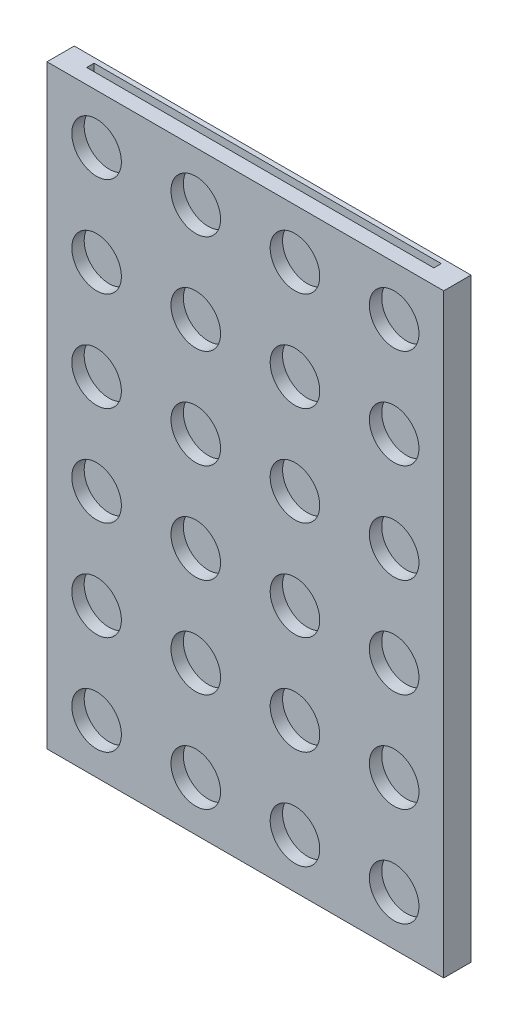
ISO-10303-21;
HEADER;
FILE_DESCRIPTION(('STEP AP214'),'2;1');
FILE_NAME('part.step','',(''),(''),'','','');
FILE_SCHEMA(('AUTOMOTIVE_DESIGN { 1 0 10303 214 1 1 1 1 }'));
ENDSEC;
DATA;
#1=APPLICATION_CONTEXT('core data for automotive mechanical design processes');
#2=APPLICATION_PROTOCOL_DEFINITION('international standard','automotive_design',2000,#1);
#3=PRODUCT_CONTEXT('',#1,'mechanical');
#4=PRODUCT('Part','Part','',(#3));
#5=PRODUCT_RELATED_PRODUCT_CATEGORY('part','',(#4));
#6=PRODUCT_DEFINITION_FORMATION('','',#4);
#7=PRODUCT_DEFINITION_CONTEXT('part definition',#1,'design');
#8=PRODUCT_DEFINITION('design','',#6,#7);
#9=PRODUCT_DEFINITION_SHAPE('','',#8);
#10=(LENGTH_UNIT() NAMED_UNIT(*) SI_UNIT(.MILLI.,.METRE.));
#11=(NAMED_UNIT(*) PLANE_ANGLE_UNIT() SI_UNIT($,.RADIAN.));
#12=(NAMED_UNIT(*) SI_UNIT($,.STERADIAN.) SOLID_ANGLE_UNIT());
#13=UNCERTAINTY_MEASURE_WITH_UNIT(LENGTH_MEASURE(1.E-05),#10,'distance_accuracy_value','');
#14=(GEOMETRIC_REPRESENTATION_CONTEXT(3) GLOBAL_UNCERTAINTY_ASSIGNED_CONTEXT((#13)) GLOBAL_UNIT_ASSIGNED_CONTEXT((#10,
#11,#12)) REPRESENTATION_CONTEXT('',''));
#15=CARTESIAN_POINT('',(0.,0.,0.));
#16=DIRECTION('',(0.,0.,1.));
#17=DIRECTION('',(1.,0.,0.));
#18=AXIS2_PLACEMENT_3D('',#15,#16,#17);
#19=CARTESIAN_POINT('',(0.,0.,6.985));
#20=DIRECTION('',(0.,0.,-1.));
#21=DIRECTION('',(-1.,0.,0.));
#22=AXIS2_PLACEMENT_3D('',#19,#20,#21);
#23=PLANE('',#22);
#24=CARTESIAN_POINT('',(88.9,88.9,6.985));
#25=DIRECTION('',(0.,0.,1.));
#26=DIRECTION('',(1.,0.,0.));
#27=AXIS2_PLACEMENT_3D('',#24,#25,#26);
#28=CIRCLE('',#27,6.34999999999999);
#29=CARTESIAN_POINT('',(95.25,88.9,6.985));
#30=VERTEX_POINT('',#29);
#31=EDGE_CURVE('E303',#30,#30,#28,.T.);
#32=ORIENTED_EDGE('',*,*,#31,.F.);
#33=EDGE_LOOP('',(#32));
#34=FACE_BOUND('',#33,.T.);
#35=CARTESIAN_POINT('',(63.5,88.9,6.985));
#36=DIRECTION('',(0.,0.,1.));
#37=DIRECTION('',(1.,0.,0.));
#38=AXIS2_PLACEMENT_3D('',#35,#36,#37);
#39=CIRCLE('',#38,6.34999999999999);
#40=CARTESIAN_POINT('',(69.85,88.9,6.985));
#41=VERTEX_POINT('',#40);
#42=EDGE_CURVE('E328',#41,#41,#39,.T.);
#43=ORIENTED_EDGE('',*,*,#42,.F.);
#44=EDGE_LOOP('',(#43));
#45=FACE_BOUND('',#44,.T.);
#46=CARTESIAN_POINT('',(38.1,88.9,6.985));
#47=DIRECTION('',(0.,0.,1.));
#48=DIRECTION('',(1.,0.,0.));
#49=AXIS2_PLACEMENT_3D('',#46,#47,#48);
#50=CIRCLE('',#49,6.35);
#51=CARTESIAN_POINT('',(44.45,88.9,6.985));
#52=VERTEX_POINT('',#51);
#53=EDGE_CURVE('E319',#52,#52,#50,.T.);
#54=ORIENTED_EDGE('',*,*,#53,.F.);
#55=EDGE_LOOP('',(#54));
#56=FACE_BOUND('',#55,.T.);
#57=CARTESIAN_POINT('',(12.7,38.1,6.985));
#58=DIRECTION('',(0.,0.,1.));
#59=DIRECTION('',(1.,0.,0.));
#60=AXIS2_PLACEMENT_3D('',#57,#58,#59);
#61=CIRCLE('',#60,6.35);
#62=CARTESIAN_POINT('',(19.05,38.1,6.985));
#63=VERTEX_POINT('',#62);
#64=EDGE_CURVE('E280',#63,#63,#61,.T.);
#65=ORIENTED_EDGE('',*,*,#64,.F.);
#66=EDGE_LOOP('',(#65));
#67=FACE_BOUND('',#66,.T.);
#68=CARTESIAN_POINT('',(38.1,139.7,6.985));
#69=DIRECTION('',(0.,0.,1.));
#70=DIRECTION('',(1.,0.,0.));
#71=AXIS2_PLACEMENT_3D('',#68,#69,#70);
#72=CIRCLE('',#71,6.35);
#73=CARTESIAN_POINT('',(44.45,139.7,6.985));
#74=VERTEX_POINT('',#73);
#75=EDGE_CURVE('E367',#74,#74,#72,.T.);
#76=ORIENTED_EDGE('',*,*,#75,.F.);
#77=EDGE_LOOP('',(#76));
#78=FACE_BOUND('',#77,.T.);
#79=CARTESIAN_POINT('',(63.5,139.7,6.985));
#80=DIRECTION('',(0.,0.,1.));
#81=DIRECTION('',(1.,0.,0.));
#82=AXIS2_PLACEMENT_3D('',#79,#80,#81);
#83=CIRCLE('',#82,6.34999999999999);
#84=CARTESIAN_POINT('',(69.85,139.7,6.985));
#85=VERTEX_POINT('',#84);
#86=EDGE_CURVE('E376',#85,#85,#83,.T.);
#87=ORIENTED_EDGE('',*,*,#86,.F.);
#88=EDGE_LOOP('',(#87));
#89=FACE_BOUND('',#88,.T.);
#90=CARTESIAN_POINT('',(88.9,139.7,6.985));
#91=DIRECTION('',(0.,0.,1.));
#92=DIRECTION('',(1.,0.,0.));
#93=AXIS2_PLACEMENT_3D('',#90,#91,#92);
#94=CIRCLE('',#93,6.34999999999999);
#95=CARTESIAN_POINT('',(95.25,139.7,6.985));
#96=VERTEX_POINT('',#95);
#97=EDGE_CURVE('E384',#96,#96,#94,.T.);
#98=ORIENTED_EDGE('',*,*,#97,.F.);
#99=EDGE_LOOP('',(#98));
#100=FACE_BOUND('',#99,.T.);
#101=CARTESIAN_POINT('',(12.7,88.9,6.985));
#102=DIRECTION('',(0.,0.,1.));
#103=DIRECTION('',(1.,0.,0.));
#104=AXIS2_PLACEMENT_3D('',#101,#102,#103);
#105=CIRCLE('',#104,6.35);
#106=CARTESIAN_POINT('',(19.05,88.9,6.985));
#107=VERTEX_POINT('',#106);
#108=EDGE_CURVE('E360',#107,#107,#105,.T.);
#109=ORIENTED_EDGE('',*,*,#108,.F.);
#110=EDGE_LOOP('',(#109));
#111=FACE_BOUND('',#110,.T.);
#112=CARTESIAN_POINT('',(38.1,38.1,6.985));
#113=DIRECTION('',(0.,0.,1.));
#114=DIRECTION('',(1.,0.,0.));
#115=AXIS2_PLACEMENT_3D('',#112,#113,#114);
#116=CIRCLE('',#115,6.35);
#117=CARTESIAN_POINT('',(44.45,38.1,6.985));
#118=VERTEX_POINT('',#117);
#119=EDGE_CURVE('E255',#118,#118,#116,.T.);
#120=ORIENTED_EDGE('',*,*,#119,.F.);
#121=EDGE_LOOP('',(#120));
#122=FACE_BOUND('',#121,.T.);
#123=CARTESIAN_POINT('',(63.5,38.1,6.985));
#124=DIRECTION('',(0.,0.,1.));
#125=DIRECTION('',(1.,0.,0.));
#126=AXIS2_PLACEMENT_3D('',#123,#124,#125);
#127=CIRCLE('',#126,6.35);
#128=CARTESIAN_POINT('',(69.85,38.1,6.985));
#129=VERTEX_POINT('',#128);
#130=EDGE_CURVE('E264',#129,#129,#127,.T.);
#131=ORIENTED_EDGE('',*,*,#130,.F.);
#132=EDGE_LOOP('',(#131));
#133=FACE_BOUND('',#132,.T.);
#134=CARTESIAN_POINT('',(88.9,38.1,6.985));
#135=DIRECTION('',(0.,0.,1.));
#136=DIRECTION('',(1.,0.,0.));
#137=AXIS2_PLACEMENT_3D('',#134,#135,#136);
#138=CIRCLE('',#137,6.35);
#139=CARTESIAN_POINT('',(95.25,38.1,6.985));
#140=VERTEX_POINT('',#139);
#141=EDGE_CURVE('E239',#140,#140,#138,.T.);
#142=ORIENTED_EDGE('',*,*,#141,.F.);
#143=EDGE_LOOP('',(#142));
#144=FACE_BOUND('',#143,.T.);
#145=CARTESIAN_POINT('',(12.7,139.7,6.985));
#146=DIRECTION('',(0.,0.,1.));
#147=DIRECTION('',(1.,0.,0.));
#148=AXIS2_PLACEMENT_3D('',#145,#146,#147);
#149=CIRCLE('',#148,6.35);
#150=CARTESIAN_POINT('',(19.05,139.7,6.985));
#151=VERTEX_POINT('',#150);
#152=EDGE_CURVE('E371',#151,#151,#149,.T.);
#153=ORIENTED_EDGE('',*,*,#152,.F.);
#154=EDGE_LOOP('',(#153));
#155=FACE_BOUND('',#154,.T.);
#156=DIRECTION('',(0.,-1.,0.));
#157=VECTOR('',#156,1.);
#158=CARTESIAN_POINT('',(0.,0.,6.985));
#159=LINE('',#158,#157);
#160=CARTESIAN_POINT('',(0.,152.4,6.985));
#161=VERTEX_POINT('',#160);
#162=CARTESIAN_POINT('',(0.,0.,6.985));
#163=VERTEX_POINT('',#162);
#164=EDGE_CURVE('E407',#161,#163,#159,.T.);
#165=ORIENTED_EDGE('',*,*,#164,.T.);
#166=DIRECTION('',(1.,0.,0.));
#167=VECTOR('',#166,1.);
#168=CARTESIAN_POINT('',(0.,0.,6.985));
#169=LINE('',#168,#167);
#170=CARTESIAN_POINT('',(101.6,0.,6.985));
#171=VERTEX_POINT('',#170);
#172=EDGE_CURVE('E411',#163,#171,#169,.T.);
#173=ORIENTED_EDGE('',*,*,#172,.T.);
#174=DIRECTION('',(0.,1.,0.));
#175=VECTOR('',#174,1.);
#176=CARTESIAN_POINT('',(101.6,0.,6.985));
#177=LINE('',#176,#175);
#178=CARTESIAN_POINT('',(101.6,152.4,6.985));
#179=VERTEX_POINT('',#178);
#180=EDGE_CURVE('E415',#171,#179,#177,.T.);
#181=ORIENTED_EDGE('',*,*,#180,.T.);
#182=DIRECTION('',(-1.,0.,0.));
#183=VECTOR('',#182,1.);
#184=CARTESIAN_POINT('',(0.,152.4,6.985));
#185=LINE('',#184,#183);
#186=EDGE_CURVE('E418',#179,#161,#185,.T.);
#187=ORIENTED_EDGE('',*,*,#186,.T.);
#188=EDGE_LOOP('',(#165,#173,#181,#187));
#189=FACE_BOUND('',#188,.T.);
#190=CARTESIAN_POINT('',(12.7,12.7,6.985));
#191=DIRECTION('',(0.,0.,-1.));
#192=DIRECTION('',(-1.,0.,0.));
#193=AXIS2_PLACEMENT_3D('',#190,#191,#192);
#194=CIRCLE('',#193,6.35);
#195=CARTESIAN_POINT('',(6.35,12.7,6.985));
#196=VERTEX_POINT('',#195);
#197=EDGE_CURVE('E248',#196,#196,#194,.T.);
#198=ORIENTED_EDGE('',*,*,#197,.T.);
#199=EDGE_LOOP('',(#198));
#200=FACE_BOUND('',#199,.T.);
#201=CARTESIAN_POINT('',(38.1,12.7,6.985));
#202=DIRECTION('',(0.,0.,-1.));
#203=DIRECTION('',(-1.,0.,0.));
#204=AXIS2_PLACEMENT_3D('',#201,#202,#203);
#205=CIRCLE('',#204,6.35);
#206=CARTESIAN_POINT('',(31.75,12.7,6.985));
#207=VERTEX_POINT('',#206);
#208=EDGE_CURVE('E215',#207,#207,#205,.T.);
#209=ORIENTED_EDGE('',*,*,#208,.T.);
#210=EDGE_LOOP('',(#209));
#211=FACE_BOUND('',#210,.T.);
#212=CARTESIAN_POINT('',(63.5,12.7,6.985));
#213=DIRECTION('',(0.,0.,-1.));
#214=DIRECTION('',(-1.,0.,0.));
#215=AXIS2_PLACEMENT_3D('',#212,#213,#214);
#216=CIRCLE('',#215,6.35);
#217=CARTESIAN_POINT('',(57.15,12.7,6.985));
#218=VERTEX_POINT('',#217);
#219=EDGE_CURVE('E224',#218,#218,#216,.T.);
#220=ORIENTED_EDGE('',*,*,#219,.T.);
#221=EDGE_LOOP('',(#220));
#222=FACE_BOUND('',#221,.T.);
#223=CARTESIAN_POINT('',(88.9,12.7,6.985));
#224=DIRECTION('',(0.,0.,-1.));
#225=DIRECTION('',(-1.,0.,0.));
#226=AXIS2_PLACEMENT_3D('',#223,#224,#225);
#227=CIRCLE('',#226,6.35);
#228=CARTESIAN_POINT('',(82.55,12.7,6.985));
#229=VERTEX_POINT('',#228);
#230=EDGE_CURVE('E232',#229,#229,#227,.T.);
#231=ORIENTED_EDGE('',*,*,#230,.T.);
#232=EDGE_LOOP('',(#231));
#233=FACE_BOUND('',#232,.T.);
#234=CARTESIAN_POINT('',(12.7,114.3,6.985));
#235=DIRECTION('',(0.,0.,-1.));
#236=DIRECTION('',(-1.,0.,0.));
#237=AXIS2_PLACEMENT_3D('',#234,#235,#236);
#238=CIRCLE('',#237,6.35);
#239=CARTESIAN_POINT('',(6.35,114.3,6.985));
#240=VERTEX_POINT('',#239);
#241=EDGE_CURVE('E352',#240,#240,#238,.T.);
#242=ORIENTED_EDGE('',*,*,#241,.T.);
#243=EDGE_LOOP('',(#242));
#244=FACE_BOUND('',#243,.T.);
#245=CARTESIAN_POINT('',(38.1,114.3,6.985));
#246=DIRECTION('',(0.,0.,-1.));
#247=DIRECTION('',(-1.,0.,0.));
#248=AXIS2_PLACEMENT_3D('',#245,#246,#247);
#249=CIRCLE('',#248,6.35);
#250=CARTESIAN_POINT('',(31.75,114.3,6.985));
#251=VERTEX_POINT('',#250);
#252=EDGE_CURVE('E344',#251,#251,#249,.T.);
#253=ORIENTED_EDGE('',*,*,#252,.T.);
#254=EDGE_LOOP('',(#253));
#255=FACE_BOUND('',#254,.T.);
#256=CARTESIAN_POINT('',(63.5,114.3,6.985));
#257=DIRECTION('',(0.,0.,-1.));
#258=DIRECTION('',(-1.,0.,0.));
#259=AXIS2_PLACEMENT_3D('',#256,#257,#258);
#260=CIRCLE('',#259,6.34999999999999);
#261=CARTESIAN_POINT('',(57.15,114.3,6.985));
#262=VERTEX_POINT('',#261);
#263=EDGE_CURVE('E335',#262,#262,#260,.T.);
#264=ORIENTED_EDGE('',*,*,#263,.T.);
#265=EDGE_LOOP('',(#264));
#266=FACE_BOUND('',#265,.T.);
#267=CARTESIAN_POINT('',(88.9,114.3,6.985));
#268=DIRECTION('',(0.,0.,-1.));
#269=DIRECTION('',(-1.,0.,0.));
#270=AXIS2_PLACEMENT_3D('',#267,#268,#269);
#271=CIRCLE('',#270,6.34999999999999);
#272=CARTESIAN_POINT('',(82.55,114.3,6.985));
#273=VERTEX_POINT('',#272);
#274=EDGE_CURVE('E392',#273,#273,#271,.T.);
#275=ORIENTED_EDGE('',*,*,#274,.T.);
#276=EDGE_LOOP('',(#275));
#277=FACE_BOUND('',#276,.T.);
#278=CARTESIAN_POINT('',(38.1,63.5,6.985));
#279=DIRECTION('',(0.,0.,-1.));
#280=DIRECTION('',(-1.,0.,0.));
#281=AXIS2_PLACEMENT_3D('',#278,#279,#280);
#282=CIRCLE('',#281,6.35);
#283=CARTESIAN_POINT('',(31.75,63.5,6.985));
#284=VERTEX_POINT('',#283);
#285=EDGE_CURVE('E287',#284,#284,#282,.T.);
#286=ORIENTED_EDGE('',*,*,#285,.T.);
#287=EDGE_LOOP('',(#286));
#288=FACE_BOUND('',#287,.T.);
#289=CARTESIAN_POINT('',(63.5,63.5,6.985));
#290=DIRECTION('',(0.,0.,-1.));
#291=DIRECTION('',(-1.,0.,0.));
#292=AXIS2_PLACEMENT_3D('',#289,#290,#291);
#293=CIRCLE('',#292,6.34999999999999);
#294=CARTESIAN_POINT('',(57.15,63.5,6.985));
#295=VERTEX_POINT('',#294);
#296=EDGE_CURVE('E296',#295,#295,#293,.T.);
#297=ORIENTED_EDGE('',*,*,#296,.T.);
#298=EDGE_LOOP('',(#297));
#299=FACE_BOUND('',#298,.T.);
#300=CARTESIAN_POINT('',(88.9,63.5,6.985));
#301=DIRECTION('',(0.,0.,-1.));
#302=DIRECTION('',(-1.,0.,0.));
#303=AXIS2_PLACEMENT_3D('',#300,#301,#302);
#304=CIRCLE('',#303,6.34999999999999);
#305=CARTESIAN_POINT('',(82.55,63.5,6.985));
#306=VERTEX_POINT('',#305);
#307=EDGE_CURVE('E271',#306,#306,#304,.T.);
#308=ORIENTED_EDGE('',*,*,#307,.T.);
#309=EDGE_LOOP('',(#308));
#310=FACE_BOUND('',#309,.T.);
#311=CARTESIAN_POINT('',(12.7,63.5,6.985));
#312=DIRECTION('',(0.,0.,-1.));
#313=DIRECTION('',(-1.,0.,0.));
#314=AXIS2_PLACEMENT_3D('',#311,#312,#313);
#315=CIRCLE('',#314,6.35);
#316=CARTESIAN_POINT('',(6.35,63.5,6.985));
#317=VERTEX_POINT('',#316);
#318=EDGE_CURVE('E312',#317,#317,#315,.T.);
#319=ORIENTED_EDGE('',*,*,#318,.T.);
#320=EDGE_LOOP('',(#319));
#321=FACE_BOUND('',#320,.T.);
#322=ADVANCED_FACE('F45',(#34,#45,#56,#67,#78,#89,#100,#111,#122,#133,#144,#155,#189,#200,#211,
#222,#233,#244,#255,#266,#277,#288,#299,#310,#321),#23,.F.);
#323=CARTESIAN_POINT('',(0.,0.,6.985));
#324=DIRECTION('',(1.,0.,0.));
#325=DIRECTION('',(0.,0.,-1.));
#326=AXIS2_PLACEMENT_3D('',#323,#324,#325);
#327=PLANE('',#326);
#328=DIRECTION('',(0.,-1.,0.));
#329=VECTOR('',#328,1.);
#330=CARTESIAN_POINT('',(0.,0.,0.));
#331=LINE('',#330,#329);
#332=CARTESIAN_POINT('',(0.,152.4,0.));
#333=VERTEX_POINT('',#332);
#334=CARTESIAN_POINT('',(0.,0.,0.));
#335=VERTEX_POINT('',#334);
#336=EDGE_CURVE('E403',#333,#335,#331,.T.);
#337=ORIENTED_EDGE('',*,*,#336,.T.);
#338=DIRECTION('',(0.,0.,-1.));
#339=VECTOR('',#338,1.);
#340=CARTESIAN_POINT('',(0.,0.,6.985));
#341=LINE('',#340,#339);
#342=EDGE_CURVE('E444',#163,#335,#341,.T.);
#343=ORIENTED_EDGE('',*,*,#342,.F.);
#344=ORIENTED_EDGE('',*,*,#164,.F.);
#345=DIRECTION('',(0.,0.,-1.));
#346=VECTOR('',#345,1.);
#347=CARTESIAN_POINT('',(0.,152.4,6.985));
#348=LINE('',#347,#346);
#349=EDGE_CURVE('E421',#161,#333,#348,.T.);
#350=ORIENTED_EDGE('',*,*,#349,.T.);
#351=EDGE_LOOP('',(#337,#343,#344,#350));
#352=FACE_BOUND('',#351,.T.);
#353=ADVANCED_FACE('F47',(#352),#327,.F.);
#354=CARTESIAN_POINT('',(0.,0.,6.985));
#355=DIRECTION('',(0.,1.,0.));
#356=DIRECTION('',(0.,0.,1.));
#357=AXIS2_PLACEMENT_3D('',#354,#355,#356);
#358=PLANE('',#357);
#359=DIRECTION('',(1.,0.,0.));
#360=VECTOR('',#359,1.);
#361=CARTESIAN_POINT('',(0.,0.,0.));
#362=LINE('',#361,#360);
#363=CARTESIAN_POINT('',(101.6,0.,0.));
#364=VERTEX_POINT('',#363);
#365=EDGE_CURVE('E425',#335,#364,#362,.T.);
#366=ORIENTED_EDGE('',*,*,#365,.T.);
#367=DIRECTION('',(0.,0.,-1.));
#368=VECTOR('',#367,1.);
#369=CARTESIAN_POINT('',(101.6,0.,6.985));
#370=LINE('',#369,#368);
#371=EDGE_CURVE('E440',#171,#364,#370,.T.);
#372=ORIENTED_EDGE('',*,*,#371,.F.);
#373=ORIENTED_EDGE('',*,*,#172,.F.);
#374=ORIENTED_EDGE('',*,*,#342,.T.);
#375=EDGE_LOOP('',(#366,#372,#373,#374));
#376=FACE_BOUND('',#375,.T.);
#377=ADVANCED_FACE('F482',(#376),#358,.F.);
#378=CARTESIAN_POINT('',(101.6,0.,6.985));
#379=DIRECTION('',(-1.,0.,0.));
#380=DIRECTION('',(0.,0.,1.));
#381=AXIS2_PLACEMENT_3D('',#378,#379,#380);
#382=PLANE('',#381);
#383=DIRECTION('',(0.,1.,0.));
#384=VECTOR('',#383,1.);
#385=CARTESIAN_POINT('',(101.6,0.,0.));
#386=LINE('',#385,#384);
#387=CARTESIAN_POINT('',(101.6,152.4,0.));
#388=VERTEX_POINT('',#387);
#389=EDGE_CURVE('E428',#364,#388,#386,.T.);
#390=ORIENTED_EDGE('',*,*,#389,.T.);
#391=DIRECTION('',(0.,0.,-1.));
#392=VECTOR('',#391,1.);
#393=CARTESIAN_POINT('',(101.6,152.4,6.985));
#394=LINE('',#393,#392);
#395=EDGE_CURVE('E436',#179,#388,#394,.T.);
#396=ORIENTED_EDGE('',*,*,#395,.F.);
#397=ORIENTED_EDGE('',*,*,#180,.F.);
#398=ORIENTED_EDGE('',*,*,#371,.T.);
#399=EDGE_LOOP('',(#390,#396,#397,#398));
#400=FACE_BOUND('',#399,.T.);
#401=ADVANCED_FACE('F495',(#400),#382,.F.);
#402=CARTESIAN_POINT('',(0.,152.4,6.985));
#403=DIRECTION('',(0.,-1.,0.));
#404=DIRECTION('',(0.,0.,-1.));
#405=AXIS2_PLACEMENT_3D('',#402,#403,#404);
#406=PLANE('',#405);
#407=DIRECTION('',(1.,0.,0.));
#408=VECTOR('',#407,1.);
#409=CARTESIAN_POINT('',(95.25,152.4,3.17499999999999));
#410=LINE('',#409,#408);
#411=CARTESIAN_POINT('',(6.35,152.4,3.175));
#412=VERTEX_POINT('',#411);
#413=CARTESIAN_POINT('',(95.25,152.4,3.17499999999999));
#414=VERTEX_POINT('',#413);
#415=EDGE_CURVE('E191',#412,#414,#410,.T.);
#416=ORIENTED_EDGE('',*,*,#415,.F.);
#417=DIRECTION('',(0.,0.,1.));
#418=VECTOR('',#417,1.);
#419=CARTESIAN_POINT('',(6.35,152.4,3.175));
#420=LINE('',#419,#418);
#421=CARTESIAN_POINT('',(6.35,152.4,1.27));
#422=VERTEX_POINT('',#421);
#423=EDGE_CURVE('E166',#422,#412,#420,.T.);
#424=ORIENTED_EDGE('',*,*,#423,.F.);
#425=DIRECTION('',(-1.,0.,0.));
#426=VECTOR('',#425,1.);
#427=CARTESIAN_POINT('',(6.35,152.4,1.27));
#428=LINE('',#427,#426);
#429=CARTESIAN_POINT('',(95.25,152.4,1.27));
#430=VERTEX_POINT('',#429);
#431=EDGE_CURVE('E176',#430,#422,#428,.T.);
#432=ORIENTED_EDGE('',*,*,#431,.F.);
#433=DIRECTION('',(0.,0.,-1.));
#434=VECTOR('',#433,1.);
#435=CARTESIAN_POINT('',(95.25,152.4,1.27));
#436=LINE('',#435,#434);
#437=EDGE_CURVE('E195',#414,#430,#436,.T.);
#438=ORIENTED_EDGE('',*,*,#437,.F.);
#439=EDGE_LOOP('',(#416,#424,#432,#438));
#440=FACE_BOUND('',#439,.T.);
#441=DIRECTION('',(-1.,0.,0.));
#442=VECTOR('',#441,1.);
#443=CARTESIAN_POINT('',(0.,152.4,0.));
#444=LINE('',#443,#442);
#445=EDGE_CURVE('E412',#388,#333,#444,.T.);
#446=ORIENTED_EDGE('',*,*,#445,.T.);
#447=ORIENTED_EDGE('',*,*,#349,.F.);
#448=ORIENTED_EDGE('',*,*,#186,.F.);
#449=ORIENTED_EDGE('',*,*,#395,.T.);
#450=EDGE_LOOP('',(#446,#447,#448,#449));
#451=FACE_BOUND('',#450,.T.);
#452=ADVANCED_FACE('F492',(#440,#451),#406,.F.);
#453=CARTESIAN_POINT('',(0.,0.,0.));
#454=DIRECTION('',(0.,0.,-1.));
#455=DIRECTION('',(-1.,0.,0.));
#456=AXIS2_PLACEMENT_3D('',#453,#454,#455);
#457=PLANE('',#456);
#458=DIRECTION('',(1.,0.,0.));
#459=VECTOR('',#458,1.);
#460=CARTESIAN_POINT('',(7.62,144.78,0.));
#461=LINE('',#460,#459);
#462=CARTESIAN_POINT('',(7.62,144.78,0.));
#463=VERTEX_POINT('',#462);
#464=CARTESIAN_POINT('',(93.98,144.78,0.));
#465=VERTEX_POINT('',#464);
#466=EDGE_CURVE('E61',#463,#465,#461,.T.);
#467=ORIENTED_EDGE('',*,*,#466,.F.);
#468=DIRECTION('',(0.,1.,0.));
#469=VECTOR('',#468,1.);
#470=CARTESIAN_POINT('',(7.62,7.62,0.));
#471=LINE('',#470,#469);
#472=CARTESIAN_POINT('',(7.62,7.62,0.));
#473=VERTEX_POINT('',#472);
#474=EDGE_CURVE('E156',#473,#463,#471,.T.);
#475=ORIENTED_EDGE('',*,*,#474,.F.);
#476=DIRECTION('',(-1.,0.,0.));
#477=VECTOR('',#476,1.);
#478=CARTESIAN_POINT('',(93.98,7.62,0.));
#479=LINE('',#478,#477);
#480=CARTESIAN_POINT('',(93.98,7.62,0.));
#481=VERTEX_POINT('',#480);
#482=EDGE_CURVE('E138',#481,#473,#479,.T.);
#483=ORIENTED_EDGE('',*,*,#482,.F.);
#484=DIRECTION('',(0.,-1.,0.));
#485=VECTOR('',#484,1.);
#486=CARTESIAN_POINT('',(93.98,144.78,0.));
#487=LINE('',#486,#485);
#488=EDGE_CURVE('E148',#465,#481,#487,.T.);
#489=ORIENTED_EDGE('',*,*,#488,.F.);
#490=EDGE_LOOP('',(#467,#475,#483,#489));
#491=FACE_BOUND('',#490,.T.);
#492=ORIENTED_EDGE('',*,*,#336,.F.);
#493=ORIENTED_EDGE('',*,*,#445,.F.);
#494=ORIENTED_EDGE('',*,*,#389,.F.);
#495=ORIENTED_EDGE('',*,*,#365,.F.);
#496=EDGE_LOOP('',(#492,#493,#494,#495));
#497=FACE_BOUND('',#496,.T.);
#498=ADVANCED_FACE('F153',(#491,#497),#457,.T.);
#499=CARTESIAN_POINT('',(12.7,139.7,3.81));
#500=DIRECTION('',(0.,0.,1.));
#501=DIRECTION('',(1.,0.,0.));
#502=AXIS2_PLACEMENT_3D('',#499,#500,#501);
#503=CYLINDRICAL_SURFACE('',#502,6.35);
#504=CARTESIAN_POINT('',(12.7,139.7,3.81));
#505=DIRECTION('',(0.,0.,1.));
#506=DIRECTION('',(1.,0.,0.));
#507=AXIS2_PLACEMENT_3D('',#504,#505,#506);
#508=CIRCLE('',#507,6.35);
#509=CARTESIAN_POINT('',(19.05,139.7,3.81));
#510=VERTEX_POINT('',#509);
#511=EDGE_CURVE('E399',#510,#510,#508,.T.);
#512=ORIENTED_EDGE('',*,*,#511,.F.);
#513=EDGE_LOOP('',(#512));
#514=FACE_BOUND('',#513,.T.);
#515=ORIENTED_EDGE('',*,*,#152,.T.);
#516=EDGE_LOOP('',(#515));
#517=FACE_BOUND('',#516,.T.);
#518=ADVANCED_FACE('F488',(#514,#517),#503,.F.);
#519=CARTESIAN_POINT('',(12.7,139.7,3.81));
#520=DIRECTION('',(0.,0.,1.));
#521=DIRECTION('',(1.,0.,0.));
#522=AXIS2_PLACEMENT_3D('',#519,#520,#521);
#523=PLANE('',#522);
#524=ORIENTED_EDGE('',*,*,#511,.T.);
#525=EDGE_LOOP('',(#524));
#526=FACE_BOUND('',#525,.T.);
#527=ADVANCED_FACE('F639',(#526),#523,.T.);
#528=CARTESIAN_POINT('',(12.7,12.7,3.81));
#529=DIRECTION('',(0.,0.,1.));
#530=DIRECTION('',(1.,0.,0.));
#531=AXIS2_PLACEMENT_3D('',#528,#529,#530);
#532=CYLINDRICAL_SURFACE('',#531,6.35);
#533=CARTESIAN_POINT('',(12.7,12.7,3.81));
#534=DIRECTION('',(0.,0.,-1.));
#535=DIRECTION('',(-1.,0.,0.));
#536=AXIS2_PLACEMENT_3D('',#533,#534,#535);
#537=CIRCLE('',#536,6.35);
#538=CARTESIAN_POINT('',(6.35,12.7,3.81));
#539=VERTEX_POINT('',#538);
#540=EDGE_CURVE('E219',#539,#539,#537,.T.);
#541=ORIENTED_EDGE('',*,*,#540,.T.);
#542=EDGE_LOOP('',(#541));
#543=FACE_BOUND('',#542,.T.);
#544=ORIENTED_EDGE('',*,*,#197,.F.);
#545=EDGE_LOOP('',(#544));
#546=FACE_BOUND('',#545,.T.);
#547=ADVANCED_FACE('F641',(#543,#546),#532,.F.);
#548=CARTESIAN_POINT('',(12.7,12.7,3.81));
#549=DIRECTION('',(0.,0.,-1.));
#550=DIRECTION('',(-1.,0.,0.));
#551=AXIS2_PLACEMENT_3D('',#548,#549,#550);
#552=PLANE('',#551);
#553=ORIENTED_EDGE('',*,*,#540,.F.);
#554=EDGE_LOOP('',(#553));
#555=FACE_BOUND('',#554,.T.);
#556=ADVANCED_FACE('F646',(#555),#552,.F.);
#557=CARTESIAN_POINT('',(88.9,38.1,3.81));
#558=DIRECTION('',(0.,0.,1.));
#559=DIRECTION('',(1.,0.,0.));
#560=AXIS2_PLACEMENT_3D('',#557,#558,#559);
#561=CYLINDRICAL_SURFACE('',#560,6.35);
#562=CARTESIAN_POINT('',(88.9,38.1,3.81));
#563=DIRECTION('',(0.,0.,1.));
#564=DIRECTION('',(1.,0.,0.));
#565=AXIS2_PLACEMENT_3D('',#562,#563,#564);
#566=CIRCLE('',#565,6.35);
#567=CARTESIAN_POINT('',(95.25,38.1,3.81));
#568=VERTEX_POINT('',#567);
#569=EDGE_CURVE('E244',#568,#568,#566,.T.);
#570=ORIENTED_EDGE('',*,*,#569,.F.);
#571=EDGE_LOOP('',(#570));
#572=FACE_BOUND('',#571,.T.);
#573=ORIENTED_EDGE('',*,*,#141,.T.);
#574=EDGE_LOOP('',(#573));
#575=FACE_BOUND('',#574,.T.);
#576=ADVANCED_FACE('F680',(#572,#575),#561,.F.);
#577=CARTESIAN_POINT('',(88.9,38.1,3.81));
#578=DIRECTION('',(0.,0.,1.));
#579=DIRECTION('',(1.,0.,0.));
#580=AXIS2_PLACEMENT_3D('',#577,#578,#579);
#581=PLANE('',#580);
#582=ORIENTED_EDGE('',*,*,#569,.T.);
#583=EDGE_LOOP('',(#582));
#584=FACE_BOUND('',#583,.T.);
#585=ADVANCED_FACE('F690',(#584),#581,.T.);
#586=CARTESIAN_POINT('',(63.5,38.1,3.81));
#587=DIRECTION('',(0.,0.,1.));
#588=DIRECTION('',(1.,0.,0.));
#589=AXIS2_PLACEMENT_3D('',#586,#587,#588);
#590=CYLINDRICAL_SURFACE('',#589,6.35);
#591=CARTESIAN_POINT('',(63.5,38.1,3.81));
#592=DIRECTION('',(0.,0.,1.));
#593=DIRECTION('',(1.,0.,0.));
#594=AXIS2_PLACEMENT_3D('',#591,#592,#593);
#595=CIRCLE('',#594,6.35);
#596=CARTESIAN_POINT('',(69.85,38.1,3.81));
#597=VERTEX_POINT('',#596);
#598=EDGE_CURVE('E243',#597,#597,#595,.T.);
#599=ORIENTED_EDGE('',*,*,#598,.F.);
#600=EDGE_LOOP('',(#599));
#601=FACE_BOUND('',#600,.T.);
#602=ORIENTED_EDGE('',*,*,#130,.T.);
#603=EDGE_LOOP('',(#602));
#604=FACE_BOUND('',#603,.T.);
#605=ADVANCED_FACE('F700',(#601,#604),#590,.F.);
#606=CARTESIAN_POINT('',(63.5,38.1,3.81));
#607=DIRECTION('',(0.,0.,1.));
#608=DIRECTION('',(1.,0.,0.));
#609=AXIS2_PLACEMENT_3D('',#606,#607,#608);
#610=PLANE('',#609);
#611=ORIENTED_EDGE('',*,*,#598,.T.);
#612=EDGE_LOOP('',(#611));
#613=FACE_BOUND('',#612,.T.);
#614=ADVANCED_FACE('F710',(#613),#610,.T.);
#615=CARTESIAN_POINT('',(38.1,38.1,3.81));
#616=DIRECTION('',(0.,0.,1.));
#617=DIRECTION('',(1.,0.,0.));
#618=AXIS2_PLACEMENT_3D('',#615,#616,#617);
#619=CYLINDRICAL_SURFACE('',#618,6.35);
#620=CARTESIAN_POINT('',(38.1,38.1,3.81));
#621=DIRECTION('',(0.,0.,1.));
#622=DIRECTION('',(1.,0.,0.));
#623=AXIS2_PLACEMENT_3D('',#620,#621,#622);
#624=CIRCLE('',#623,6.35);
#625=CARTESIAN_POINT('',(44.45,38.1,3.81));
#626=VERTEX_POINT('',#625);
#627=EDGE_CURVE('E260',#626,#626,#624,.T.);
#628=ORIENTED_EDGE('',*,*,#627,.F.);
#629=EDGE_LOOP('',(#628));
#630=FACE_BOUND('',#629,.T.);
#631=ORIENTED_EDGE('',*,*,#119,.T.);
#632=EDGE_LOOP('',(#631));
#633=FACE_BOUND('',#632,.T.);
#634=ADVANCED_FACE('F720',(#630,#633),#619,.F.);
#635=CARTESIAN_POINT('',(38.1,38.1,3.81));
#636=DIRECTION('',(0.,0.,1.));
#637=DIRECTION('',(1.,0.,0.));
#638=AXIS2_PLACEMENT_3D('',#635,#636,#637);
#639=PLANE('',#638);
#640=ORIENTED_EDGE('',*,*,#627,.T.);
#641=EDGE_LOOP('',(#640));
#642=FACE_BOUND('',#641,.T.);
#643=ADVANCED_FACE('F730',(#642),#639,.T.);
#644=CARTESIAN_POINT('',(38.1,12.7,3.81));
#645=DIRECTION('',(0.,0.,1.));
#646=DIRECTION('',(1.,0.,0.));
#647=AXIS2_PLACEMENT_3D('',#644,#645,#646);
#648=CYLINDRICAL_SURFACE('',#647,6.35);
#649=CARTESIAN_POINT('',(38.1,12.7,3.81));
#650=DIRECTION('',(0.,0.,-1.));
#651=DIRECTION('',(-1.,0.,0.));
#652=AXIS2_PLACEMENT_3D('',#649,#650,#651);
#653=CIRCLE('',#652,6.35);
#654=CARTESIAN_POINT('',(31.75,12.7,3.81));
#655=VERTEX_POINT('',#654);
#656=EDGE_CURVE('E220',#655,#655,#653,.T.);
#657=ORIENTED_EDGE('',*,*,#656,.T.);
#658=EDGE_LOOP('',(#657));
#659=FACE_BOUND('',#658,.T.);
#660=ORIENTED_EDGE('',*,*,#208,.F.);
#661=EDGE_LOOP('',(#660));
#662=FACE_BOUND('',#661,.T.);
#663=ADVANCED_FACE('F740',(#659,#662),#648,.F.);
#664=CARTESIAN_POINT('',(38.1,12.7,3.81));
#665=DIRECTION('',(0.,0.,-1.));
#666=DIRECTION('',(-1.,0.,0.));
#667=AXIS2_PLACEMENT_3D('',#664,#665,#666);
#668=PLANE('',#667);
#669=ORIENTED_EDGE('',*,*,#656,.F.);
#670=EDGE_LOOP('',(#669));
#671=FACE_BOUND('',#670,.T.);
#672=ADVANCED_FACE('F750',(#671),#668,.F.);
#673=CARTESIAN_POINT('',(63.5,12.7,3.81));
#674=DIRECTION('',(0.,0.,1.));
#675=DIRECTION('',(1.,0.,0.));
#676=AXIS2_PLACEMENT_3D('',#673,#674,#675);
#677=CYLINDRICAL_SURFACE('',#676,6.35);
#678=CARTESIAN_POINT('',(63.5,12.7,3.81));
#679=DIRECTION('',(0.,0.,-1.));
#680=DIRECTION('',(-1.,0.,0.));
#681=AXIS2_PLACEMENT_3D('',#678,#679,#680);
#682=CIRCLE('',#681,6.35);
#683=CARTESIAN_POINT('',(57.15,12.7,3.81));
#684=VERTEX_POINT('',#683);
#685=EDGE_CURVE('E228',#684,#684,#682,.T.);
#686=ORIENTED_EDGE('',*,*,#685,.T.);
#687=EDGE_LOOP('',(#686));
#688=FACE_BOUND('',#687,.T.);
#689=ORIENTED_EDGE('',*,*,#219,.F.);
#690=EDGE_LOOP('',(#689));
#691=FACE_BOUND('',#690,.T.);
#692=ADVANCED_FACE('F760',(#688,#691),#677,.F.);
#693=CARTESIAN_POINT('',(63.5,12.7,3.81));
#694=DIRECTION('',(0.,0.,-1.));
#695=DIRECTION('',(-1.,0.,0.));
#696=AXIS2_PLACEMENT_3D('',#693,#694,#695);
#697=PLANE('',#696);
#698=ORIENTED_EDGE('',*,*,#685,.F.);
#699=EDGE_LOOP('',(#698));
#700=FACE_BOUND('',#699,.T.);
#701=ADVANCED_FACE('F770',(#700),#697,.F.);
#702=CARTESIAN_POINT('',(88.9,12.7,3.81));
#703=DIRECTION('',(0.,0.,1.));
#704=DIRECTION('',(1.,0.,0.));
#705=AXIS2_PLACEMENT_3D('',#702,#703,#704);
#706=CYLINDRICAL_SURFACE('',#705,6.35);
#707=CARTESIAN_POINT('',(88.9,12.7,3.81));
#708=DIRECTION('',(0.,0.,-1.));
#709=DIRECTION('',(-1.,0.,0.));
#710=AXIS2_PLACEMENT_3D('',#707,#708,#709);
#711=CIRCLE('',#710,6.35);
#712=CARTESIAN_POINT('',(82.55,12.7,3.81));
#713=VERTEX_POINT('',#712);
#714=EDGE_CURVE('E205',#713,#713,#711,.T.);
#715=ORIENTED_EDGE('',*,*,#714,.T.);
#716=EDGE_LOOP('',(#715));
#717=FACE_BOUND('',#716,.T.);
#718=ORIENTED_EDGE('',*,*,#230,.F.);
#719=EDGE_LOOP('',(#718));
#720=FACE_BOUND('',#719,.T.);
#721=ADVANCED_FACE('F780',(#717,#720),#706,.F.);
#722=CARTESIAN_POINT('',(88.9,12.7,3.81));
#723=DIRECTION('',(0.,0.,-1.));
#724=DIRECTION('',(-1.,0.,0.));
#725=AXIS2_PLACEMENT_3D('',#722,#723,#724);
#726=PLANE('',#725);
#727=ORIENTED_EDGE('',*,*,#714,.F.);
#728=EDGE_LOOP('',(#727));
#729=FACE_BOUND('',#728,.T.);
#730=ADVANCED_FACE('F603',(#729),#726,.F.);
#731=CARTESIAN_POINT('',(12.7,88.9,3.81));
#732=DIRECTION('',(0.,0.,1.));
#733=DIRECTION('',(1.,0.,0.));
#734=AXIS2_PLACEMENT_3D('',#731,#732,#733);
#735=CYLINDRICAL_SURFACE('',#734,6.35);
#736=CARTESIAN_POINT('',(12.7,88.9,3.81));
#737=DIRECTION('',(0.,0.,1.));
#738=DIRECTION('',(1.,0.,0.));
#739=AXIS2_PLACEMENT_3D('',#736,#737,#738);
#740=CIRCLE('',#739,6.35);
#741=CARTESIAN_POINT('',(19.05,88.9,3.81));
#742=VERTEX_POINT('',#741);
#743=EDGE_CURVE('E323',#742,#742,#740,.T.);
#744=ORIENTED_EDGE('',*,*,#743,.F.);
#745=EDGE_LOOP('',(#744));
#746=FACE_BOUND('',#745,.T.);
#747=ORIENTED_EDGE('',*,*,#108,.T.);
#748=EDGE_LOOP('',(#747));
#749=FACE_BOUND('',#748,.T.);
#750=ADVANCED_FACE('F600',(#746,#749),#735,.F.);
#751=CARTESIAN_POINT('',(12.7,88.9,3.81));
#752=DIRECTION('',(0.,0.,1.));
#753=DIRECTION('',(1.,0.,0.));
#754=AXIS2_PLACEMENT_3D('',#751,#752,#753);
#755=PLANE('',#754);
#756=ORIENTED_EDGE('',*,*,#743,.T.);
#757=EDGE_LOOP('',(#756));
#758=FACE_BOUND('',#757,.T.);
#759=ADVANCED_FACE('F595',(#758),#755,.T.);
#760=CARTESIAN_POINT('',(12.7,114.3,3.81));
#761=DIRECTION('',(0.,0.,1.));
#762=DIRECTION('',(1.,0.,0.));
#763=AXIS2_PLACEMENT_3D('',#760,#761,#762);
#764=CYLINDRICAL_SURFACE('',#763,6.35);
#765=CARTESIAN_POINT('',(12.7,114.3,3.81));
#766=DIRECTION('',(0.,0.,-1.));
#767=DIRECTION('',(-1.,0.,0.));
#768=AXIS2_PLACEMENT_3D('',#765,#766,#767);
#769=CIRCLE('',#768,6.35);
#770=CARTESIAN_POINT('',(6.35,114.3,3.81));
#771=VERTEX_POINT('',#770);
#772=EDGE_CURVE('E356',#771,#771,#769,.T.);
#773=ORIENTED_EDGE('',*,*,#772,.T.);
#774=EDGE_LOOP('',(#773));
#775=FACE_BOUND('',#774,.T.);
#776=ORIENTED_EDGE('',*,*,#241,.F.);
#777=EDGE_LOOP('',(#776));
#778=FACE_BOUND('',#777,.T.);
#779=ADVANCED_FACE('F592',(#775,#778),#764,.F.);
#780=CARTESIAN_POINT('',(12.7,114.3,3.81));
#781=DIRECTION('',(0.,0.,-1.));
#782=DIRECTION('',(-1.,0.,0.));
#783=AXIS2_PLACEMENT_3D('',#780,#781,#782);
#784=PLANE('',#783);
#785=ORIENTED_EDGE('',*,*,#772,.F.);
#786=EDGE_LOOP('',(#785));
#787=FACE_BOUND('',#786,.T.);
#788=ADVANCED_FACE('F587',(#787),#784,.F.);
#789=CARTESIAN_POINT('',(38.1,114.3,3.81));
#790=DIRECTION('',(0.,0.,1.));
#791=DIRECTION('',(1.,0.,0.));
#792=AXIS2_PLACEMENT_3D('',#789,#790,#791);
#793=CYLINDRICAL_SURFACE('',#792,6.35);
#794=CARTESIAN_POINT('',(38.1,114.3,3.81));
#795=DIRECTION('',(0.,0.,-1.));
#796=DIRECTION('',(-1.,0.,0.));
#797=AXIS2_PLACEMENT_3D('',#794,#795,#796);
#798=CIRCLE('',#797,6.35);
#799=CARTESIAN_POINT('',(31.75,114.3,3.81));
#800=VERTEX_POINT('',#799);
#801=EDGE_CURVE('E348',#800,#800,#798,.T.);
#802=ORIENTED_EDGE('',*,*,#801,.T.);
#803=EDGE_LOOP('',(#802));
#804=FACE_BOUND('',#803,.T.);
#805=ORIENTED_EDGE('',*,*,#252,.F.);
#806=EDGE_LOOP('',(#805));
#807=FACE_BOUND('',#806,.T.);
#808=ADVANCED_FACE('F584',(#804,#807),#793,.F.);
#809=CARTESIAN_POINT('',(38.1,114.3,3.81));
#810=DIRECTION('',(0.,0.,-1.));
#811=DIRECTION('',(-1.,0.,0.));
#812=AXIS2_PLACEMENT_3D('',#809,#810,#811);
#813=PLANE('',#812);
#814=ORIENTED_EDGE('',*,*,#801,.F.);
#815=EDGE_LOOP('',(#814));
#816=FACE_BOUND('',#815,.T.);
#817=ADVANCED_FACE('F578',(#816),#813,.F.);
#818=CARTESIAN_POINT('',(63.5,114.3,3.81));
#819=DIRECTION('',(0.,0.,1.));
#820=DIRECTION('',(1.,0.,0.));
#821=AXIS2_PLACEMENT_3D('',#818,#819,#820);
#822=CYLINDRICAL_SURFACE('',#821,6.34999999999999);
#823=CARTESIAN_POINT('',(63.5,114.3,3.81));
#824=DIRECTION('',(0.,0.,-1.));
#825=DIRECTION('',(-1.,0.,0.));
#826=AXIS2_PLACEMENT_3D('',#823,#824,#825);
#827=CIRCLE('',#826,6.34999999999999);
#828=CARTESIAN_POINT('',(57.15,114.3,3.81));
#829=VERTEX_POINT('',#828);
#830=EDGE_CURVE('E340',#829,#829,#827,.T.);
#831=ORIENTED_EDGE('',*,*,#830,.T.);
#832=EDGE_LOOP('',(#831));
#833=FACE_BOUND('',#832,.T.);
#834=ORIENTED_EDGE('',*,*,#263,.F.);
#835=EDGE_LOOP('',(#834));
#836=FACE_BOUND('',#835,.T.);
#837=ADVANCED_FACE('F574',(#833,#836),#822,.F.);
#838=CARTESIAN_POINT('',(63.5,114.3,3.81));
#839=DIRECTION('',(0.,0.,-1.));
#840=DIRECTION('',(-1.,0.,0.));
#841=AXIS2_PLACEMENT_3D('',#838,#839,#840);
#842=PLANE('',#841);
#843=ORIENTED_EDGE('',*,*,#830,.F.);
#844=EDGE_LOOP('',(#843));
#845=FACE_BOUND('',#844,.T.);
#846=ADVANCED_FACE('F577',(#845),#842,.F.);
#847=CARTESIAN_POINT('',(88.9,114.3,3.81));
#848=DIRECTION('',(0.,0.,1.));
#849=DIRECTION('',(1.,0.,0.));
#850=AXIS2_PLACEMENT_3D('',#847,#848,#849);
#851=CYLINDRICAL_SURFACE('',#850,6.34999999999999);
#852=CARTESIAN_POINT('',(88.9,114.3,3.81));
#853=DIRECTION('',(0.,0.,-1.));
#854=DIRECTION('',(-1.,0.,0.));
#855=AXIS2_PLACEMENT_3D('',#852,#853,#854);
#856=CIRCLE('',#855,6.34999999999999);
#857=CARTESIAN_POINT('',(82.55,114.3,3.81));
#858=VERTEX_POINT('',#857);
#859=EDGE_CURVE('E339',#858,#858,#856,.T.);
#860=ORIENTED_EDGE('',*,*,#859,.T.);
#861=EDGE_LOOP('',(#860));
#862=FACE_BOUND('',#861,.T.);
#863=ORIENTED_EDGE('',*,*,#274,.F.);
#864=EDGE_LOOP('',(#863));
#865=FACE_BOUND('',#864,.T.);
#866=ADVANCED_FACE('F582',(#862,#865),#851,.F.);
#867=CARTESIAN_POINT('',(88.9,114.3,3.81));
#868=DIRECTION('',(0.,0.,-1.));
#869=DIRECTION('',(-1.,0.,0.));
#870=AXIS2_PLACEMENT_3D('',#867,#868,#869);
#871=PLANE('',#870);
#872=ORIENTED_EDGE('',*,*,#859,.F.);
#873=EDGE_LOOP('',(#872));
#874=FACE_BOUND('',#873,.T.);
#875=ADVANCED_FACE('F629',(#874),#871,.F.);
#876=CARTESIAN_POINT('',(88.9,139.7,3.81));
#877=DIRECTION('',(0.,0.,1.));
#878=DIRECTION('',(1.,0.,0.));
#879=AXIS2_PLACEMENT_3D('',#876,#877,#878);
#880=CYLINDRICAL_SURFACE('',#879,6.34999999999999);
#881=CARTESIAN_POINT('',(88.9,139.7,3.81));
#882=DIRECTION('',(0.,0.,1.));
#883=DIRECTION('',(1.,0.,0.));
#884=AXIS2_PLACEMENT_3D('',#881,#882,#883);
#885=CIRCLE('',#884,6.34999999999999);
#886=CARTESIAN_POINT('',(95.25,139.7,3.81));
#887=VERTEX_POINT('',#886);
#888=EDGE_CURVE('E388',#887,#887,#885,.T.);
#889=ORIENTED_EDGE('',*,*,#888,.F.);
#890=EDGE_LOOP('',(#889));
#891=FACE_BOUND('',#890,.T.);
#892=ORIENTED_EDGE('',*,*,#97,.T.);
#893=EDGE_LOOP('',(#892));
#894=FACE_BOUND('',#893,.T.);
#895=ADVANCED_FACE('F626',(#891,#894),#880,.F.);
#896=CARTESIAN_POINT('',(88.9,139.7,3.81));
#897=DIRECTION('',(0.,0.,1.));
#898=DIRECTION('',(1.,0.,0.));
#899=AXIS2_PLACEMENT_3D('',#896,#897,#898);
#900=PLANE('',#899);
#901=ORIENTED_EDGE('',*,*,#888,.T.);
#902=EDGE_LOOP('',(#901));
#903=FACE_BOUND('',#902,.T.);
#904=ADVANCED_FACE('F621',(#903),#900,.T.);
#905=CARTESIAN_POINT('',(63.5,139.7,3.81));
#906=DIRECTION('',(0.,0.,1.));
#907=DIRECTION('',(1.,0.,0.));
#908=AXIS2_PLACEMENT_3D('',#905,#906,#907);
#909=CYLINDRICAL_SURFACE('',#908,6.34999999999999);
#910=CARTESIAN_POINT('',(63.5,139.7,3.81));
#911=DIRECTION('',(0.,0.,1.));
#912=DIRECTION('',(1.,0.,0.));
#913=AXIS2_PLACEMENT_3D('',#910,#911,#912);
#914=CIRCLE('',#913,6.34999999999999);
#915=CARTESIAN_POINT('',(69.85,139.7,3.81));
#916=VERTEX_POINT('',#915);
#917=EDGE_CURVE('E380',#916,#916,#914,.T.);
#918=ORIENTED_EDGE('',*,*,#917,.F.);
#919=EDGE_LOOP('',(#918));
#920=FACE_BOUND('',#919,.T.);
#921=ORIENTED_EDGE('',*,*,#86,.T.);
#922=EDGE_LOOP('',(#921));
#923=FACE_BOUND('',#922,.T.);
#924=ADVANCED_FACE('F618',(#920,#923),#909,.F.);
#925=CARTESIAN_POINT('',(63.5,139.7,3.81));
#926=DIRECTION('',(0.,0.,1.));
#927=DIRECTION('',(1.,0.,0.));
#928=AXIS2_PLACEMENT_3D('',#925,#926,#927);
#929=PLANE('',#928);
#930=ORIENTED_EDGE('',*,*,#917,.T.);
#931=EDGE_LOOP('',(#930));
#932=FACE_BOUND('',#931,.T.);
#933=ADVANCED_FACE('F612',(#932),#929,.T.);
#934=CARTESIAN_POINT('',(38.1,139.7,3.81));
#935=DIRECTION('',(0.,0.,1.));
#936=DIRECTION('',(1.,0.,0.));
#937=AXIS2_PLACEMENT_3D('',#934,#935,#936);
#938=CYLINDRICAL_SURFACE('',#937,6.35);
#939=CARTESIAN_POINT('',(38.1,139.7,3.81));
#940=DIRECTION('',(0.,0.,1.));
#941=DIRECTION('',(1.,0.,0.));
#942=AXIS2_PLACEMENT_3D('',#939,#940,#941);
#943=CIRCLE('',#942,6.35);
#944=CARTESIAN_POINT('',(44.45,139.7,3.81));
#945=VERTEX_POINT('',#944);
#946=EDGE_CURVE('E372',#945,#945,#943,.T.);
#947=ORIENTED_EDGE('',*,*,#946,.F.);
#948=EDGE_LOOP('',(#947));
#949=FACE_BOUND('',#948,.T.);
#950=ORIENTED_EDGE('',*,*,#75,.T.);
#951=EDGE_LOOP('',(#950));
#952=FACE_BOUND('',#951,.T.);
#953=ADVANCED_FACE('F608',(#949,#952),#938,.F.);
#954=CARTESIAN_POINT('',(38.1,139.7,3.81));
#955=DIRECTION('',(0.,0.,1.));
#956=DIRECTION('',(1.,0.,0.));
#957=AXIS2_PLACEMENT_3D('',#954,#955,#956);
#958=PLANE('',#957);
#959=ORIENTED_EDGE('',*,*,#946,.T.);
#960=EDGE_LOOP('',(#959));
#961=FACE_BOUND('',#960,.T.);
#962=ADVANCED_FACE('F611',(#961),#958,.T.);
#963=CARTESIAN_POINT('',(38.1,63.5,3.81));
#964=DIRECTION('',(0.,0.,1.));
#965=DIRECTION('',(1.,0.,0.));
#966=AXIS2_PLACEMENT_3D('',#963,#964,#965);
#967=CYLINDRICAL_SURFACE('',#966,6.35);
#968=CARTESIAN_POINT('',(38.1,63.5,3.81));
#969=DIRECTION('',(0.,0.,-1.));
#970=DIRECTION('',(-1.,0.,0.));
#971=AXIS2_PLACEMENT_3D('',#968,#969,#970);
#972=CIRCLE('',#971,6.35);
#973=CARTESIAN_POINT('',(31.75,63.5,3.81));
#974=VERTEX_POINT('',#973);
#975=EDGE_CURVE('E292',#974,#974,#972,.T.);
#976=ORIENTED_EDGE('',*,*,#975,.T.);
#977=EDGE_LOOP('',(#976));
#978=FACE_BOUND('',#977,.T.);
#979=ORIENTED_EDGE('',*,*,#285,.F.);
#980=EDGE_LOOP('',(#979));
#981=FACE_BOUND('',#980,.T.);
#982=ADVANCED_FACE('F616',(#978,#981),#967,.F.);
#983=CARTESIAN_POINT('',(38.1,63.5,3.81));
#984=DIRECTION('',(0.,0.,-1.));
#985=DIRECTION('',(-1.,0.,0.));
#986=AXIS2_PLACEMENT_3D('',#983,#984,#985);
#987=PLANE('',#986);
#988=ORIENTED_EDGE('',*,*,#975,.F.);
#989=EDGE_LOOP('',(#988));
#990=FACE_BOUND('',#989,.T.);
#991=ADVANCED_FACE('F904',(#990),#987,.F.);
#992=CARTESIAN_POINT('',(63.5,63.5,3.81));
#993=DIRECTION('',(0.,0.,1.));
#994=DIRECTION('',(1.,0.,0.));
#995=AXIS2_PLACEMENT_3D('',#992,#993,#994);
#996=CYLINDRICAL_SURFACE('',#995,6.34999999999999);
#997=CARTESIAN_POINT('',(63.5,63.5,3.81));
#998=DIRECTION('',(0.,0.,-1.));
#999=DIRECTION('',(-1.,0.,0.));
#1000=AXIS2_PLACEMENT_3D('',#997,#998,#999);
#1001=CIRCLE('',#1000,6.34999999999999);
#1002=CARTESIAN_POINT('',(57.15,63.5,3.81));
#1003=VERTEX_POINT('',#1002);
#1004=EDGE_CURVE('E275',#1003,#1003,#1001,.T.);
#1005=ORIENTED_EDGE('',*,*,#1004,.T.);
#1006=EDGE_LOOP('',(#1005));
#1007=FACE_BOUND('',#1006,.T.);
#1008=ORIENTED_EDGE('',*,*,#296,.F.);
#1009=EDGE_LOOP('',(#1008));
#1010=FACE_BOUND('',#1009,.T.);
#1011=ADVANCED_FACE('F914',(#1007,#1010),#996,.F.);
#1012=CARTESIAN_POINT('',(63.5,63.5,3.81));
#1013=DIRECTION('',(0.,0.,-1.));
#1014=DIRECTION('',(-1.,0.,0.));
#1015=AXIS2_PLACEMENT_3D('',#1012,#1013,#1014);
#1016=PLANE('',#1015);
#1017=ORIENTED_EDGE('',*,*,#1004,.F.);
#1018=EDGE_LOOP('',(#1017));
#1019=FACE_BOUND('',#1018,.T.);
#1020=ADVANCED_FACE('F924',(#1019),#1016,.F.);
#1021=CARTESIAN_POINT('',(88.9,63.5,3.81));
#1022=DIRECTION('',(0.,0.,1.));
#1023=DIRECTION('',(1.,0.,0.));
#1024=AXIS2_PLACEMENT_3D('',#1021,#1022,#1023);
#1025=CYLINDRICAL_SURFACE('',#1024,6.34999999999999);
#1026=CARTESIAN_POINT('',(88.9,63.5,3.81));
#1027=DIRECTION('',(0.,0.,-1.));
#1028=DIRECTION('',(-1.,0.,0.));
#1029=AXIS2_PLACEMENT_3D('',#1026,#1027,#1028);
#1030=CIRCLE('',#1029,6.34999999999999);
#1031=CARTESIAN_POINT('',(82.55,63.5,3.81));
#1032=VERTEX_POINT('',#1031);
#1033=EDGE_CURVE('E276',#1032,#1032,#1030,.T.);
#1034=ORIENTED_EDGE('',*,*,#1033,.T.);
#1035=EDGE_LOOP('',(#1034));
#1036=FACE_BOUND('',#1035,.T.);
#1037=ORIENTED_EDGE('',*,*,#307,.F.);
#1038=EDGE_LOOP('',(#1037));
#1039=FACE_BOUND('',#1038,.T.);
#1040=ADVANCED_FACE('F934',(#1036,#1039),#1025,.F.);
#1041=CARTESIAN_POINT('',(88.9,63.5,3.81));
#1042=DIRECTION('',(0.,0.,-1.));
#1043=DIRECTION('',(-1.,0.,0.));
#1044=AXIS2_PLACEMENT_3D('',#1041,#1042,#1043);
#1045=PLANE('',#1044);
#1046=ORIENTED_EDGE('',*,*,#1033,.F.);
#1047=EDGE_LOOP('',(#1046));
#1048=FACE_BOUND('',#1047,.T.);
#1049=ADVANCED_FACE('F944',(#1048),#1045,.F.);
#1050=CARTESIAN_POINT('',(12.7,38.1,3.81));
#1051=DIRECTION('',(0.,0.,1.));
#1052=DIRECTION('',(1.,0.,0.));
#1053=AXIS2_PLACEMENT_3D('',#1050,#1051,#1052);
#1054=CYLINDRICAL_SURFACE('',#1053,6.35);
#1055=CARTESIAN_POINT('',(12.7,38.1,3.81));
#1056=DIRECTION('',(0.,0.,1.));
#1057=DIRECTION('',(1.,0.,0.));
#1058=AXIS2_PLACEMENT_3D('',#1055,#1056,#1057);
#1059=CIRCLE('',#1058,6.35);
#1060=CARTESIAN_POINT('',(19.05,38.1,3.81));
#1061=VERTEX_POINT('',#1060);
#1062=EDGE_CURVE('E259',#1061,#1061,#1059,.T.);
#1063=ORIENTED_EDGE('',*,*,#1062,.F.);
#1064=EDGE_LOOP('',(#1063));
#1065=FACE_BOUND('',#1064,.T.);
#1066=ORIENTED_EDGE('',*,*,#64,.T.);
#1067=EDGE_LOOP('',(#1066));
#1068=FACE_BOUND('',#1067,.T.);
#1069=ADVANCED_FACE('F954',(#1065,#1068),#1054,.F.);
#1070=CARTESIAN_POINT('',(12.7,38.1,3.81));
#1071=DIRECTION('',(0.,0.,1.));
#1072=DIRECTION('',(1.,0.,0.));
#1073=AXIS2_PLACEMENT_3D('',#1070,#1071,#1072);
#1074=PLANE('',#1073);
#1075=ORIENTED_EDGE('',*,*,#1062,.T.);
#1076=EDGE_LOOP('',(#1075));
#1077=FACE_BOUND('',#1076,.T.);
#1078=ADVANCED_FACE('F561',(#1077),#1074,.T.);
#1079=CARTESIAN_POINT('',(38.1,88.9,3.81));
#1080=DIRECTION('',(0.,0.,1.));
#1081=DIRECTION('',(1.,0.,0.));
#1082=AXIS2_PLACEMENT_3D('',#1079,#1080,#1081);
#1083=CYLINDRICAL_SURFACE('',#1082,6.35);
#1084=CARTESIAN_POINT('',(38.1,88.9,3.81));
#1085=DIRECTION('',(0.,0.,1.));
#1086=DIRECTION('',(1.,0.,0.));
#1087=AXIS2_PLACEMENT_3D('',#1084,#1085,#1086);
#1088=CIRCLE('',#1087,6.35);
#1089=CARTESIAN_POINT('',(44.45,88.9,3.81));
#1090=VERTEX_POINT('',#1089);
#1091=EDGE_CURVE('E324',#1090,#1090,#1088,.T.);
#1092=ORIENTED_EDGE('',*,*,#1091,.F.);
#1093=EDGE_LOOP('',(#1092));
#1094=FACE_BOUND('',#1093,.T.);
#1095=ORIENTED_EDGE('',*,*,#53,.T.);
#1096=EDGE_LOOP('',(#1095));
#1097=FACE_BOUND('',#1096,.T.);
#1098=ADVANCED_FACE('F557',(#1094,#1097),#1083,.F.);
#1099=CARTESIAN_POINT('',(38.1,88.9,3.81));
#1100=DIRECTION('',(0.,0.,1.));
#1101=DIRECTION('',(1.,0.,0.));
#1102=AXIS2_PLACEMENT_3D('',#1099,#1100,#1101);
#1103=PLANE('',#1102);
#1104=ORIENTED_EDGE('',*,*,#1091,.T.);
#1105=EDGE_LOOP('',(#1104));
#1106=FACE_BOUND('',#1105,.T.);
#1107=ADVANCED_FACE('F560',(#1106),#1103,.T.);
#1108=CARTESIAN_POINT('',(63.5,88.9,3.81));
#1109=DIRECTION('',(0.,0.,1.));
#1110=DIRECTION('',(1.,0.,0.));
#1111=AXIS2_PLACEMENT_3D('',#1108,#1109,#1110);
#1112=CYLINDRICAL_SURFACE('',#1111,6.34999999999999);
#1113=CARTESIAN_POINT('',(63.5,88.9,3.81));
#1114=DIRECTION('',(0.,0.,1.));
#1115=DIRECTION('',(1.,0.,0.));
#1116=AXIS2_PLACEMENT_3D('',#1113,#1114,#1115);
#1117=CIRCLE('',#1116,6.34999999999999);
#1118=CARTESIAN_POINT('',(69.85,88.9,3.81));
#1119=VERTEX_POINT('',#1118);
#1120=EDGE_CURVE('E307',#1119,#1119,#1117,.T.);
#1121=ORIENTED_EDGE('',*,*,#1120,.F.);
#1122=EDGE_LOOP('',(#1121));
#1123=FACE_BOUND('',#1122,.T.);
#1124=ORIENTED_EDGE('',*,*,#42,.T.);
#1125=EDGE_LOOP('',(#1124));
#1126=FACE_BOUND('',#1125,.T.);
#1127=ADVANCED_FACE('F565',(#1123,#1126),#1112,.F.);
#1128=CARTESIAN_POINT('',(63.5,88.9,3.81));
#1129=DIRECTION('',(0.,0.,1.));
#1130=DIRECTION('',(1.,0.,0.));
#1131=AXIS2_PLACEMENT_3D('',#1128,#1129,#1130);
#1132=PLANE('',#1131);
#1133=ORIENTED_EDGE('',*,*,#1120,.T.);
#1134=EDGE_LOOP('',(#1133));
#1135=FACE_BOUND('',#1134,.T.);
#1136=ADVANCED_FACE('F569',(#1135),#1132,.T.);
#1137=CARTESIAN_POINT('',(88.9,88.9,3.81));
#1138=DIRECTION('',(0.,0.,1.));
#1139=DIRECTION('',(1.,0.,0.));
#1140=AXIS2_PLACEMENT_3D('',#1137,#1138,#1139);
#1141=CYLINDRICAL_SURFACE('',#1140,6.34999999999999);
#1142=CARTESIAN_POINT('',(88.9,88.9,3.81));
#1143=DIRECTION('',(0.,0.,1.));
#1144=DIRECTION('',(1.,0.,0.));
#1145=AXIS2_PLACEMENT_3D('',#1142,#1143,#1144);
#1146=CIRCLE('',#1145,6.34999999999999);
#1147=CARTESIAN_POINT('',(95.25,88.9,3.81));
#1148=VERTEX_POINT('',#1147);
#1149=EDGE_CURVE('E308',#1148,#1148,#1146,.T.);
#1150=ORIENTED_EDGE('',*,*,#1149,.F.);
#1151=EDGE_LOOP('',(#1150));
#1152=FACE_BOUND('',#1151,.T.);
#1153=ORIENTED_EDGE('',*,*,#31,.T.);
#1154=EDGE_LOOP('',(#1153));
#1155=FACE_BOUND('',#1154,.T.);
#1156=ADVANCED_FACE('F552',(#1152,#1155),#1141,.F.);
#1157=CARTESIAN_POINT('',(88.9,88.9,3.81));
#1158=DIRECTION('',(0.,0.,1.));
#1159=DIRECTION('',(1.,0.,0.));
#1160=AXIS2_PLACEMENT_3D('',#1157,#1158,#1159);
#1161=PLANE('',#1160);
#1162=ORIENTED_EDGE('',*,*,#1149,.T.);
#1163=EDGE_LOOP('',(#1162));
#1164=FACE_BOUND('',#1163,.T.);
#1165=ADVANCED_FACE('F542',(#1164),#1161,.T.);
#1166=CARTESIAN_POINT('',(12.7,63.5,3.81));
#1167=DIRECTION('',(0.,0.,1.));
#1168=DIRECTION('',(1.,0.,0.));
#1169=AXIS2_PLACEMENT_3D('',#1166,#1167,#1168);
#1170=CYLINDRICAL_SURFACE('',#1169,6.35);
#1171=CARTESIAN_POINT('',(12.7,63.5,3.81));
#1172=DIRECTION('',(0.,0.,-1.));
#1173=DIRECTION('',(-1.,0.,0.));
#1174=AXIS2_PLACEMENT_3D('',#1171,#1172,#1173);
#1175=CIRCLE('',#1174,6.35);
#1176=CARTESIAN_POINT('',(6.35,63.5,3.81));
#1177=VERTEX_POINT('',#1176);
#1178=EDGE_CURVE('E291',#1177,#1177,#1175,.T.);
#1179=ORIENTED_EDGE('',*,*,#1178,.T.);
#1180=EDGE_LOOP('',(#1179));
#1181=FACE_BOUND('',#1180,.T.);
#1182=ORIENTED_EDGE('',*,*,#318,.F.);
#1183=EDGE_LOOP('',(#1182));
#1184=FACE_BOUND('',#1183,.T.);
#1185=ADVANCED_FACE('F539',(#1181,#1184),#1170,.F.);
#1186=CARTESIAN_POINT('',(12.7,63.5,3.81));
#1187=DIRECTION('',(0.,0.,-1.));
#1188=DIRECTION('',(-1.,0.,0.));
#1189=AXIS2_PLACEMENT_3D('',#1186,#1187,#1188);
#1190=PLANE('',#1189);
#1191=ORIENTED_EDGE('',*,*,#1178,.F.);
#1192=EDGE_LOOP('',(#1191));
#1193=FACE_BOUND('',#1192,.T.);
#1194=ADVANCED_FACE('F541',(#1193),#1190,.F.);
#1195=CARTESIAN_POINT('',(6.35,6.35000000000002,3.175));
#1196=DIRECTION('',(-1.,0.,0.));
#1197=DIRECTION('',(0.,0.,1.));
#1198=AXIS2_PLACEMENT_3D('',#1195,#1196,#1197);
#1199=PLANE('',#1198);
#1200=ORIENTED_EDGE('',*,*,#423,.T.);
#1201=DIRECTION('',(0.,1.,0.));
#1202=VECTOR('',#1201,1.);
#1203=CARTESIAN_POINT('',(6.35,6.35000000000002,3.175));
#1204=LINE('',#1203,#1202);
#1205=CARTESIAN_POINT('',(6.35,6.35000000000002,3.175));
#1206=VERTEX_POINT('',#1205);
#1207=EDGE_CURVE('E188',#1206,#412,#1204,.T.);
#1208=ORIENTED_EDGE('',*,*,#1207,.F.);
#1209=DIRECTION('',(0.,0.,1.));
#1210=VECTOR('',#1209,1.);
#1211=CARTESIAN_POINT('',(6.35,6.35000000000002,3.175));
#1212=LINE('',#1211,#1210);
#1213=CARTESIAN_POINT('',(6.35,6.35000000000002,1.27));
#1214=VERTEX_POINT('',#1213);
#1215=EDGE_CURVE('E171',#1214,#1206,#1212,.T.);
#1216=ORIENTED_EDGE('',*,*,#1215,.F.);
#1217=DIRECTION('',(0.,1.,0.));
#1218=VECTOR('',#1217,1.);
#1219=CARTESIAN_POINT('',(6.35,6.35000000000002,1.27));
#1220=LINE('',#1219,#1218);
#1221=EDGE_CURVE('E202',#1214,#422,#1220,.T.);
#1222=ORIENTED_EDGE('',*,*,#1221,.T.);
#1223=EDGE_LOOP('',(#1200,#1208,#1216,#1222));
#1224=FACE_BOUND('',#1223,.T.);
#1225=ADVANCED_FACE('F549',(#1224),#1199,.F.);
#1226=CARTESIAN_POINT('',(6.35,6.35000000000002,1.27));
#1227=DIRECTION('',(0.,0.,-1.));
#1228=DIRECTION('',(-1.,0.,0.));
#1229=AXIS2_PLACEMENT_3D('',#1226,#1227,#1228);
#1230=PLANE('',#1229);
#1231=DIRECTION('',(0.,1.,0.));
#1232=VECTOR('',#1231,1.);
#1233=CARTESIAN_POINT('',(7.62,6.35000000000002,1.27));
#1234=LINE('',#1233,#1232);
#1235=CARTESIAN_POINT('',(7.62,7.62,1.27));
#1236=VERTEX_POINT('',#1235);
#1237=CARTESIAN_POINT('',(7.62,144.78,1.27));
#1238=VERTEX_POINT('',#1237);
#1239=EDGE_CURVE('E54',#1236,#1238,#1234,.T.);
#1240=ORIENTED_EDGE('',*,*,#1239,.T.);
#1241=DIRECTION('',(1.,0.,0.));
#1242=VECTOR('',#1241,1.);
#1243=CARTESIAN_POINT('',(6.35,144.78,1.27));
#1244=LINE('',#1243,#1242);
#1245=CARTESIAN_POINT('',(93.98,144.78,1.27));
#1246=VERTEX_POINT('',#1245);
#1247=EDGE_CURVE('E11',#1238,#1246,#1244,.T.);
#1248=ORIENTED_EDGE('',*,*,#1247,.T.);
#1249=DIRECTION('',(0.,-1.,0.));
#1250=VECTOR('',#1249,1.);
#1251=CARTESIAN_POINT('',(93.98,6.35000000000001,1.27));
#1252=LINE('',#1251,#1250);
#1253=CARTESIAN_POINT('',(93.98,7.62,1.27));
#1254=VERTEX_POINT('',#1253);
#1255=EDGE_CURVE('E448',#1246,#1254,#1252,.T.);
#1256=ORIENTED_EDGE('',*,*,#1255,.T.);
#1257=DIRECTION('',(-1.,0.,0.));
#1258=VECTOR('',#1257,1.);
#1259=CARTESIAN_POINT('',(6.35,7.62,1.27));
#1260=LINE('',#1259,#1258);
#1261=EDGE_CURVE('E141',#1254,#1236,#1260,.T.);
#1262=ORIENTED_EDGE('',*,*,#1261,.T.);
#1263=EDGE_LOOP('',(#1240,#1248,#1256,#1262));
#1264=FACE_BOUND('',#1263,.T.);
#1265=ORIENTED_EDGE('',*,*,#431,.T.);
#1266=ORIENTED_EDGE('',*,*,#1221,.F.);
#1267=DIRECTION('',(-1.,0.,0.));
#1268=VECTOR('',#1267,1.);
#1269=CARTESIAN_POINT('',(6.35,6.35000000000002,1.27));
#1270=LINE('',#1269,#1268);
#1271=CARTESIAN_POINT('',(95.25,6.35000000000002,1.27));
#1272=VERTEX_POINT('',#1271);
#1273=EDGE_CURVE('E184',#1272,#1214,#1270,.T.);
#1274=ORIENTED_EDGE('',*,*,#1273,.F.);
#1275=DIRECTION('',(0.,1.,0.));
#1276=VECTOR('',#1275,1.);
#1277=CARTESIAN_POINT('',(95.25,6.35000000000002,1.27));
#1278=LINE('',#1277,#1276);
#1279=EDGE_CURVE('E206',#1272,#430,#1278,.T.);
#1280=ORIENTED_EDGE('',*,*,#1279,.T.);
#1281=EDGE_LOOP('',(#1265,#1266,#1274,#1280));
#1282=FACE_BOUND('',#1281,.T.);
#1283=ADVANCED_FACE('F455',(#1264,#1282),#1230,.F.);
#1284=CARTESIAN_POINT('',(95.25,6.35000000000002,1.27));
#1285=DIRECTION('',(1.,0.,0.));
#1286=DIRECTION('',(0.,0.,-1.));
#1287=AXIS2_PLACEMENT_3D('',#1284,#1285,#1286);
#1288=PLANE('',#1287);
#1289=ORIENTED_EDGE('',*,*,#437,.T.);
#1290=ORIENTED_EDGE('',*,*,#1279,.F.);
#1291=DIRECTION('',(0.,0.,-1.));
#1292=VECTOR('',#1291,1.);
#1293=CARTESIAN_POINT('',(95.25,6.35000000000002,1.27));
#1294=LINE('',#1293,#1292);
#1295=CARTESIAN_POINT('',(95.25,6.35000000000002,3.17499999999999));
#1296=VERTEX_POINT('',#1295);
#1297=EDGE_CURVE('E180',#1296,#1272,#1294,.T.);
#1298=ORIENTED_EDGE('',*,*,#1297,.F.);
#1299=DIRECTION('',(0.,1.,0.));
#1300=VECTOR('',#1299,1.);
#1301=CARTESIAN_POINT('',(95.25,6.35000000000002,3.17499999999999));
#1302=LINE('',#1301,#1300);
#1303=EDGE_CURVE('E209',#1296,#414,#1302,.T.);
#1304=ORIENTED_EDGE('',*,*,#1303,.T.);
#1305=EDGE_LOOP('',(#1289,#1290,#1298,#1304));
#1306=FACE_BOUND('',#1305,.T.);
#1307=ADVANCED_FACE('F1039',(#1306),#1288,.F.);
#1308=CARTESIAN_POINT('',(95.25,6.35000000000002,3.17499999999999));
#1309=DIRECTION('',(0.,0.,1.));
#1310=DIRECTION('',(1.,0.,0.));
#1311=AXIS2_PLACEMENT_3D('',#1308,#1309,#1310);
#1312=PLANE('',#1311);
#1313=ORIENTED_EDGE('',*,*,#415,.T.);
#1314=ORIENTED_EDGE('',*,*,#1303,.F.);
#1315=DIRECTION('',(1.,0.,0.));
#1316=VECTOR('',#1315,1.);
#1317=CARTESIAN_POINT('',(95.25,6.35000000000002,3.17499999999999));
#1318=LINE('',#1317,#1316);
#1319=EDGE_CURVE('E175',#1206,#1296,#1318,.T.);
#1320=ORIENTED_EDGE('',*,*,#1319,.F.);
#1321=ORIENTED_EDGE('',*,*,#1207,.T.);
#1322=EDGE_LOOP('',(#1313,#1314,#1320,#1321));
#1323=FACE_BOUND('',#1322,.T.);
#1324=ADVANCED_FACE('F470',(#1323),#1312,.F.);
#1325=CARTESIAN_POINT('',(0.,6.35000000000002,0.));
#1326=DIRECTION('',(0.,-1.,0.));
#1327=DIRECTION('',(0.,0.,-1.));
#1328=AXIS2_PLACEMENT_3D('',#1325,#1326,#1327);
#1329=PLANE('',#1328);
#1330=ORIENTED_EDGE('',*,*,#1215,.T.);
#1331=ORIENTED_EDGE('',*,*,#1319,.T.);
#1332=ORIENTED_EDGE('',*,*,#1297,.T.);
#1333=ORIENTED_EDGE('',*,*,#1273,.T.);
#1334=EDGE_LOOP('',(#1330,#1331,#1332,#1333));
#1335=FACE_BOUND('',#1334,.T.);
#1336=ADVANCED_FACE('F462',(#1335),#1329,.F.);
#1337=CARTESIAN_POINT('',(7.62,144.78,2.54));
#1338=DIRECTION('',(0.,1.,0.));
#1339=DIRECTION('',(0.,0.,1.));
#1340=AXIS2_PLACEMENT_3D('',#1337,#1338,#1339);
#1341=PLANE('',#1340);
#1342=DIRECTION('',(0.,0.,-1.));
#1343=VECTOR('',#1342,1.);
#1344=CARTESIAN_POINT('',(7.62,144.78,2.54));
#1345=LINE('',#1344,#1343);
#1346=EDGE_CURVE('E163',#1238,#463,#1345,.T.);
#1347=ORIENTED_EDGE('',*,*,#1346,.T.);
#1348=ORIENTED_EDGE('',*,*,#466,.T.);
#1349=DIRECTION('',(0.,0.,-1.));
#1350=VECTOR('',#1349,1.);
#1351=CARTESIAN_POINT('',(93.98,144.78,2.54));
#1352=LINE('',#1351,#1350);
#1353=EDGE_CURVE('E145',#1246,#465,#1352,.T.);
#1354=ORIENTED_EDGE('',*,*,#1353,.F.);
#1355=ORIENTED_EDGE('',*,*,#1247,.F.);
#1356=EDGE_LOOP('',(#1347,#1348,#1354,#1355));
#1357=FACE_BOUND('',#1356,.T.);
#1358=ADVANCED_FACE('F460',(#1357),#1341,.F.);
#1359=CARTESIAN_POINT('',(7.62,7.62,2.54));
#1360=DIRECTION('',(-1.,0.,0.));
#1361=DIRECTION('',(0.,-1.,0.));
#1362=AXIS2_PLACEMENT_3D('',#1359,#1360,#1361);
#1363=PLANE('',#1362);
#1364=DIRECTION('',(0.,0.,-1.));
#1365=VECTOR('',#1364,1.);
#1366=CARTESIAN_POINT('',(7.62,7.62,2.54));
#1367=LINE('',#1366,#1365);
#1368=EDGE_CURVE('E144',#1236,#473,#1367,.T.);
#1369=ORIENTED_EDGE('',*,*,#1368,.T.);
#1370=ORIENTED_EDGE('',*,*,#474,.T.);
#1371=ORIENTED_EDGE('',*,*,#1346,.F.);
#1372=ORIENTED_EDGE('',*,*,#1239,.F.);
#1373=EDGE_LOOP('',(#1369,#1370,#1371,#1372));
#1374=FACE_BOUND('',#1373,.T.);
#1375=ADVANCED_FACE('F459',(#1374),#1363,.F.);
#1376=CARTESIAN_POINT('',(93.98,7.62,2.54));
#1377=DIRECTION('',(0.,-1.,0.));
#1378=DIRECTION('',(0.,0.,-1.));
#1379=AXIS2_PLACEMENT_3D('',#1376,#1377,#1378);
#1380=PLANE('',#1379);
#1381=DIRECTION('',(0.,0.,-1.));
#1382=VECTOR('',#1381,1.);
#1383=CARTESIAN_POINT('',(93.98,7.62,2.54));
#1384=LINE('',#1383,#1382);
#1385=EDGE_CURVE('E69',#1254,#481,#1384,.T.);
#1386=ORIENTED_EDGE('',*,*,#1385,.T.);
#1387=ORIENTED_EDGE('',*,*,#482,.T.);
#1388=ORIENTED_EDGE('',*,*,#1368,.F.);
#1389=ORIENTED_EDGE('',*,*,#1261,.F.);
#1390=EDGE_LOOP('',(#1386,#1387,#1388,#1389));
#1391=FACE_BOUND('',#1390,.T.);
#1392=ADVANCED_FACE('F135',(#1391),#1380,.F.);
#1393=CARTESIAN_POINT('',(93.98,144.78,2.54));
#1394=DIRECTION('',(1.,0.,0.));
#1395=DIRECTION('',(0.,1.,0.));
#1396=AXIS2_PLACEMENT_3D('',#1393,#1394,#1395);
#1397=PLANE('',#1396);
#1398=ORIENTED_EDGE('',*,*,#1353,.T.);
#1399=ORIENTED_EDGE('',*,*,#488,.T.);
#1400=ORIENTED_EDGE('',*,*,#1385,.F.);
#1401=ORIENTED_EDGE('',*,*,#1255,.F.);
#1402=EDGE_LOOP('',(#1398,#1399,#1400,#1401));
#1403=FACE_BOUND('',#1402,.T.);
#1404=ADVANCED_FACE('F149',(#1403),#1397,.F.);
#1405=CLOSED_SHELL('',(#322,#353,#377,#401,#452,#498,#518,#527,#547,#556,#576,#585,#605,#614,
#634,#643,#663,#672,#692,#701,#721,#730,#750,#759,#779,#788,#808,#817,#837,#846,#866,#875,#895,
#904,#924,#933,#953,#962,#982,#991,#1011,#1020,#1040,#1049,#1069,#1078,#1098,#1107,#1127,#1136,
#1156,#1165,#1185,#1194,#1225,#1283,#1307,#1324,#1336,#1358,#1375,#1392,#1404));
#1406=MANIFOLD_SOLID_BREP('B2',#1405);
#1407=ADVANCED_BREP_SHAPE_REPRESENTATION('',(#18,#1406),#14);
#1408=SHAPE_DEFINITION_REPRESENTATION(#9,#1407);
ENDSEC;
END-ISO-10303-21;
